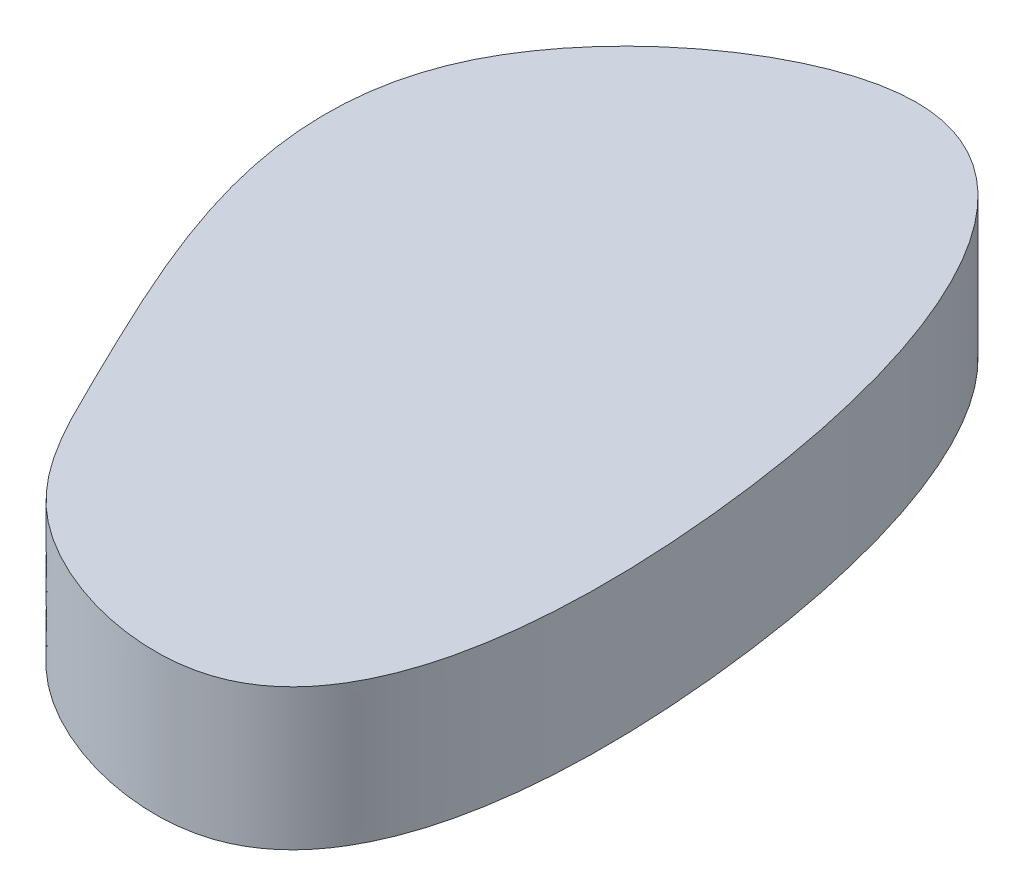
ISO-10303-21;
HEADER;
FILE_DESCRIPTION(('STEP AP214'),'2;1');
FILE_NAME('part.step','',(''),(''),'','','');
FILE_SCHEMA(('AUTOMOTIVE_DESIGN { 1 0 10303 214 1 1 1 1 }'));
ENDSEC;
DATA;
#1=APPLICATION_CONTEXT('core data for automotive mechanical design processes');
#2=APPLICATION_PROTOCOL_DEFINITION('international standard','automotive_design',2000,#1);
#3=PRODUCT_CONTEXT('',#1,'mechanical');
#4=PRODUCT('Part','Part','',(#3));
#5=PRODUCT_RELATED_PRODUCT_CATEGORY('part','',(#4));
#6=PRODUCT_DEFINITION_FORMATION('','',#4);
#7=PRODUCT_DEFINITION_CONTEXT('part definition',#1,'design');
#8=PRODUCT_DEFINITION('design','',#6,#7);
#9=PRODUCT_DEFINITION_SHAPE('','',#8);
#10=(LENGTH_UNIT() NAMED_UNIT(*) SI_UNIT(.MILLI.,.METRE.));
#11=(NAMED_UNIT(*) PLANE_ANGLE_UNIT() SI_UNIT($,.RADIAN.));
#12=(NAMED_UNIT(*) SI_UNIT($,.STERADIAN.) SOLID_ANGLE_UNIT());
#13=UNCERTAINTY_MEASURE_WITH_UNIT(LENGTH_MEASURE(1.E-05),#10,'distance_accuracy_value','');
#14=(GEOMETRIC_REPRESENTATION_CONTEXT(3) GLOBAL_UNCERTAINTY_ASSIGNED_CONTEXT((#13)) GLOBAL_UNIT_ASSIGNED_CONTEXT((#10,
#11,#12)) REPRESENTATION_CONTEXT('',''));
#15=CARTESIAN_POINT('',(0.,0.,0.));
#16=DIRECTION('',(0.,0.,1.));
#17=DIRECTION('',(1.,0.,0.));
#18=AXIS2_PLACEMENT_3D('',#15,#16,#17);
#19=CARTESIAN_POINT('',(0.,14.351,0.));
#20=CARTESIAN_POINT('',(5.37224420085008,14.351,11.0480275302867));
#21=CARTESIAN_POINT('',(16.7513845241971,14.351,34.8667400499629));
#22=CARTESIAN_POINT('',(84.9610408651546,14.351,53.8441802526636));
#23=CARTESIAN_POINT('',(94.8702447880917,14.351,-49.7134446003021));
#24=CARTESIAN_POINT('',(55.1009689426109,14.351,-161.134096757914));
#25=CARTESIAN_POINT('',(-43.9038675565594,14.351,-87.9989606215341));
#26=CARTESIAN_POINT('',(-14.6908868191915,14.351,-30.2118287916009));
#27=CARTESIAN_POINT('',(0.,14.351,0.));
#28=B_SPLINE_CURVE_WITH_KNOTS('',3,(#19,#20,#21,#22,#23,#24,#25,#26,#27),.UNSPECIFIED.,.T.,.F.,
(4,1,1,1,1,1,4),(0.,0.0816253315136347,0.185866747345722,0.379252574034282,0.627281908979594,
0.776788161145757,1.),.UNSPECIFIED.);
#29=DIRECTION('',(0.,-1.,0.));
#30=VECTOR('',#29,1.);
#31=SURFACE_OF_LINEAR_EXTRUSION('',#28,#30);
#32=CARTESIAN_POINT('',(0.,14.351,0.));
#33=VERTEX_POINT('',#32);
#34=EDGE_CURVE('E10',#33,#33,#28,.T.);
#35=ORIENTED_EDGE('',*,*,#34,.F.);
#36=EDGE_LOOP('',(#35));
#37=FACE_BOUND('',#36,.T.);
#38=CARTESIAN_POINT('',(0.,-14.351,0.));
#39=CARTESIAN_POINT('',(5.37224420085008,-14.351,11.0480275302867));
#40=CARTESIAN_POINT('',(16.7513845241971,-14.351,34.8667400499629));
#41=CARTESIAN_POINT('',(84.9610408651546,-14.351,53.8441802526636));
#42=CARTESIAN_POINT('',(94.8702447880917,-14.351,-49.7134446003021));
#43=CARTESIAN_POINT('',(55.1009689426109,-14.351,-161.134096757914));
#44=CARTESIAN_POINT('',(-43.9038675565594,-14.351,-87.9989606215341));
#45=CARTESIAN_POINT('',(-14.6908868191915,-14.351,-30.2118287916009));
#46=CARTESIAN_POINT('',(0.,-14.351,0.));
#47=B_SPLINE_CURVE_WITH_KNOTS('',3,(#38,#39,#40,#41,#42,#43,#44,#45,#46),.UNSPECIFIED.,.T.,.F.,
(4,1,1,1,1,1,4),(0.,0.0816253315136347,0.185866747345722,0.379252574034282,0.627281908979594,
0.776788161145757,1.),.UNSPECIFIED.);
#48=CARTESIAN_POINT('',(0.,-14.351,0.));
#49=VERTEX_POINT('',#48);
#50=EDGE_CURVE('E38',#49,#49,#47,.T.);
#51=ORIENTED_EDGE('',*,*,#50,.T.);
#52=EDGE_LOOP('',(#51));
#53=FACE_BOUND('',#52,.T.);
#54=ADVANCED_FACE('F29',(#37,#53),#31,.F.);
#55=CARTESIAN_POINT('',(70.9130412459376,14.351,-102.219057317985));
#56=DIRECTION('',(0.,-1.,0.));
#57=DIRECTION('',(0.,0.,-1.));
#58=AXIS2_PLACEMENT_3D('',#55,#56,#57);
#59=PLANE('',#58);
#60=ORIENTED_EDGE('',*,*,#34,.T.);
#61=EDGE_LOOP('',(#60));
#62=FACE_BOUND('',#61,.T.);
#63=ADVANCED_FACE('F52',(#62),#59,.F.);
#64=CARTESIAN_POINT('',(70.9130412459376,-14.351,-102.219057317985));
#65=DIRECTION('',(0.,-1.,0.));
#66=DIRECTION('',(0.,0.,-1.));
#67=AXIS2_PLACEMENT_3D('',#64,#65,#66);
#68=PLANE('',#67);
#69=ORIENTED_EDGE('',*,*,#50,.F.);
#70=EDGE_LOOP('',(#69));
#71=FACE_BOUND('',#70,.T.);
#72=ADVANCED_FACE('F50',(#71),#68,.T.);
#73=CLOSED_SHELL('',(#54,#63,#72));
#74=MANIFOLD_SOLID_BREP('B2',#73);
#75=ADVANCED_BREP_SHAPE_REPRESENTATION('',(#18,#74),#14);
#76=SHAPE_DEFINITION_REPRESENTATION(#9,#75);
ENDSEC;
END-ISO-10303-21;
